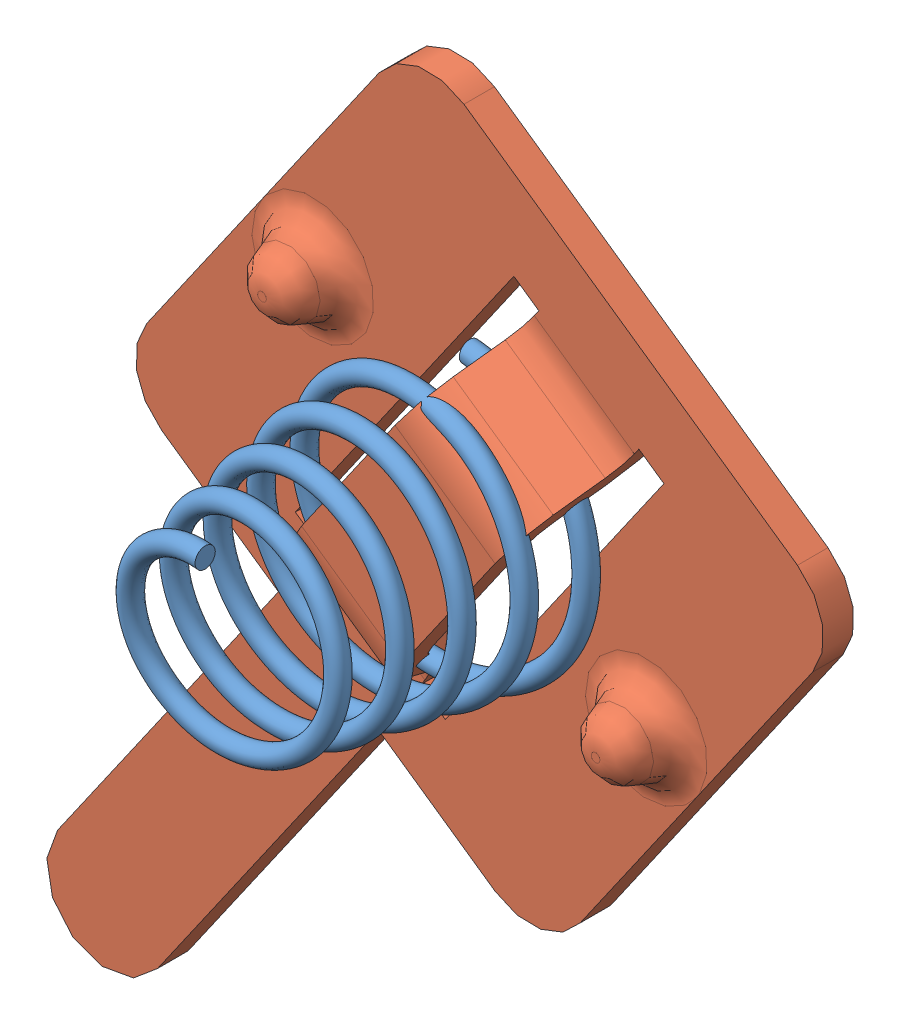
SolidWorks assembly patte piles.SLDASM, configuration Default (file format 14000). Lengths in mm.
Overall size (24.39 27.12 7.75).
2 component instances, 2 part files, 4 mates.
Components (placement in the parent):
- ressort pile-1: ressort pile.SLDPRT [Default] at (-2.268 2.3217 -0.3805) size (7.09 7.03 7.31)
- patte-1: patte.SLDPRT [Default] at (-6.3698 5.1808 -1.3805) x (0.820371 -0.571832 0) z (-0.571832 -0.820371 0) size (13 2.75 24)
Mates (geometry in assembly coordinates):
- Perpendiculaire2: perpendicular: line of ressort pile-1 through (-2.268 2.3217 -0.9436) axis (0 0 1); plane of patte-1 through (-11.4173 -10.8043 -0.6305) normal (0 0 1)
- Distance2: distance = 6.5 mm: line of ressort pile-1 through (-2.268 2.3217 -0.9436) axis (0 0 1); plane of patte-1 through (-2.6529 10.5132 -0.6305) normal (0.571832 0.820371 0)
- Distance3: distance = 6.5 mm: line of ressort pile-1 through (-2.268 2.3217 -0.9436) axis (0 0 1); plane of patte-1 through (5.9236 2.7066 -0.6305) normal (0.820371 -0.571832 0)
- Distance4: distance = 0.25 mm: point of ressort pile-1; plane of patte-1 through (-11.4173 -10.8043 -0.6305) normal (0 0 1)
